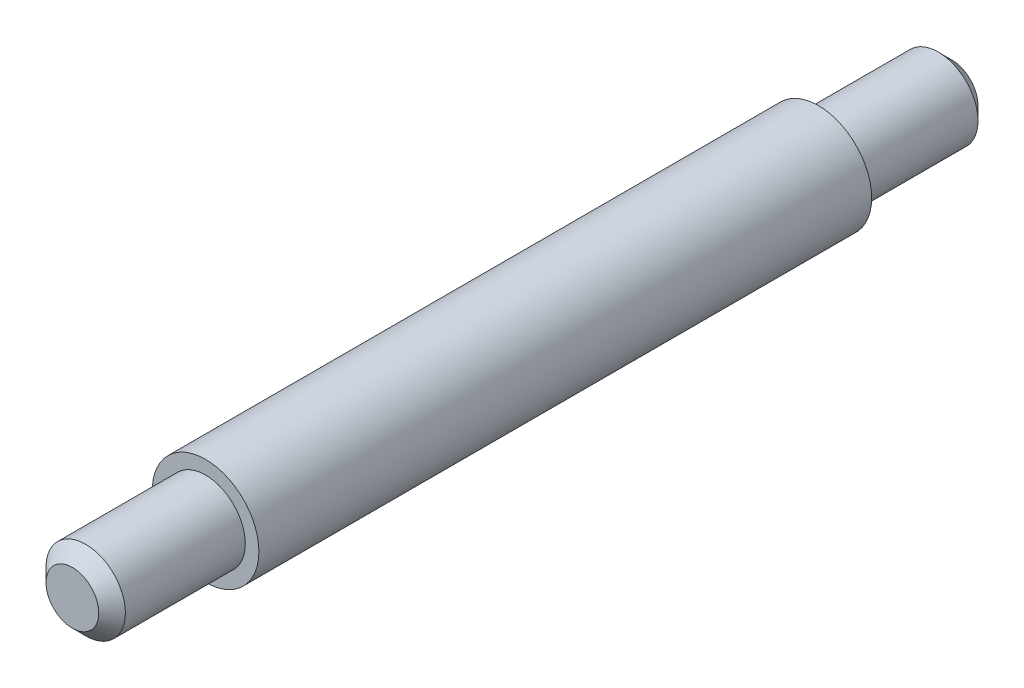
ISO-10303-21;
HEADER;
FILE_DESCRIPTION(('STEP AP214'),'2;1');
FILE_NAME('part.step','',(''),(''),'','','');
FILE_SCHEMA(('AUTOMOTIVE_DESIGN { 1 0 10303 214 1 1 1 1 }'));
ENDSEC;
DATA;
#1=APPLICATION_CONTEXT('core data for automotive mechanical design processes');
#2=APPLICATION_PROTOCOL_DEFINITION('international standard','automotive_design',2000,#1);
#3=PRODUCT_CONTEXT('',#1,'mechanical');
#4=PRODUCT('Part','Part','',(#3));
#5=PRODUCT_RELATED_PRODUCT_CATEGORY('part','',(#4));
#6=PRODUCT_DEFINITION_FORMATION('','',#4);
#7=PRODUCT_DEFINITION_CONTEXT('part definition',#1,'design');
#8=PRODUCT_DEFINITION('design','',#6,#7);
#9=PRODUCT_DEFINITION_SHAPE('','',#8);
#10=(LENGTH_UNIT() NAMED_UNIT(*) SI_UNIT(.MILLI.,.METRE.));
#11=(NAMED_UNIT(*) PLANE_ANGLE_UNIT() SI_UNIT($,.RADIAN.));
#12=(NAMED_UNIT(*) SI_UNIT($,.STERADIAN.) SOLID_ANGLE_UNIT());
#13=UNCERTAINTY_MEASURE_WITH_UNIT(LENGTH_MEASURE(1.E-05),#10,'distance_accuracy_value','');
#14=(GEOMETRIC_REPRESENTATION_CONTEXT(3) GLOBAL_UNCERTAINTY_ASSIGNED_CONTEXT((#13)) GLOBAL_UNIT_ASSIGNED_CONTEXT((#10,
#11,#12)) REPRESENTATION_CONTEXT('',''));
#15=CARTESIAN_POINT('',(0.,0.,0.));
#16=DIRECTION('',(0.,0.,1.));
#17=DIRECTION('',(1.,0.,0.));
#18=AXIS2_PLACEMENT_3D('',#15,#16,#17);
#19=CARTESIAN_POINT('',(0.,0.,11.5));
#20=DIRECTION('',(0.,0.,1.));
#21=DIRECTION('',(1.,0.,0.));
#22=AXIS2_PLACEMENT_3D('',#19,#20,#21);
#23=PLANE('',#22);
#24=CARTESIAN_POINT('',(0.,0.,11.5));
#25=DIRECTION('',(0.,0.,1.));
#26=DIRECTION('',(1.,0.,0.));
#27=AXIS2_PLACEMENT_3D('',#24,#25,#26);
#28=CIRCLE('',#27,2.);
#29=CARTESIAN_POINT('',(2.,0.,11.5));
#30=VERTEX_POINT('',#29);
#31=EDGE_CURVE('E52',#30,#30,#28,.T.);
#32=ORIENTED_EDGE('',*,*,#31,.T.);
#33=EDGE_LOOP('',(#32));
#34=FACE_BOUND('',#33,.T.);
#35=CARTESIAN_POINT('',(0.,0.,11.5));
#36=DIRECTION('',(0.,0.,1.));
#37=DIRECTION('',(1.,0.,0.));
#38=AXIS2_PLACEMENT_3D('',#35,#36,#37);
#39=CIRCLE('',#38,1.49);
#40=CARTESIAN_POINT('',(1.49,0.,11.5));
#41=VERTEX_POINT('',#40);
#42=EDGE_CURVE('E56',#41,#41,#39,.T.);
#43=ORIENTED_EDGE('',*,*,#42,.F.);
#44=EDGE_LOOP('',(#43));
#45=FACE_BOUND('',#44,.T.);
#46=ADVANCED_FACE('F32',(#34,#45),#23,.T.);
#47=CARTESIAN_POINT('',(0.,0.,11.5));
#48=DIRECTION('',(0.,0.,-1.));
#49=DIRECTION('',(-1.,0.,0.));
#50=AXIS2_PLACEMENT_3D('',#47,#48,#49);
#51=CYLINDRICAL_SURFACE('',#50,2.);
#52=ORIENTED_EDGE('',*,*,#31,.F.);
#53=EDGE_LOOP('',(#52));
#54=FACE_BOUND('',#53,.T.);
#55=CARTESIAN_POINT('',(0.,0.,-11.5));
#56=DIRECTION('',(0.,0.,1.));
#57=DIRECTION('',(1.,0.,0.));
#58=AXIS2_PLACEMENT_3D('',#55,#56,#57);
#59=CIRCLE('',#58,2.);
#60=CARTESIAN_POINT('',(2.,0.,-11.5));
#61=VERTEX_POINT('',#60);
#62=EDGE_CURVE('E53',#61,#61,#59,.T.);
#63=ORIENTED_EDGE('',*,*,#62,.T.);
#64=EDGE_LOOP('',(#63));
#65=FACE_BOUND('',#64,.T.);
#66=ADVANCED_FACE('F84',(#54,#65),#51,.T.);
#67=CARTESIAN_POINT('',(0.,0.,-11.5));
#68=DIRECTION('',(0.,0.,1.));
#69=DIRECTION('',(1.,0.,0.));
#70=AXIS2_PLACEMENT_3D('',#67,#68,#69);
#71=PLANE('',#70);
#72=CARTESIAN_POINT('',(0.,0.,-11.5));
#73=DIRECTION('',(0.,0.,1.));
#74=DIRECTION('',(1.,0.,0.));
#75=AXIS2_PLACEMENT_3D('',#72,#73,#74);
#76=CIRCLE('',#75,1.49);
#77=CARTESIAN_POINT('',(1.49,0.,-11.5));
#78=VERTEX_POINT('',#77);
#79=EDGE_CURVE('E61',#78,#78,#76,.T.);
#80=ORIENTED_EDGE('',*,*,#79,.T.);
#81=EDGE_LOOP('',(#80));
#82=FACE_BOUND('',#81,.T.);
#83=ORIENTED_EDGE('',*,*,#62,.F.);
#84=EDGE_LOOP('',(#83));
#85=FACE_BOUND('',#84,.T.);
#86=ADVANCED_FACE('F65',(#82,#85),#71,.F.);
#87=CARTESIAN_POINT('',(0.,0.,16.5));
#88=DIRECTION('',(0.,0.,-1.));
#89=DIRECTION('',(-1.,0.,0.));
#90=AXIS2_PLACEMENT_3D('',#87,#88,#89);
#91=CYLINDRICAL_SURFACE('',#90,1.49);
#92=CARTESIAN_POINT('',(0.,0.,16.));
#93=DIRECTION('',(0.,0.,1.));
#94=DIRECTION('',(1.,0.,0.));
#95=AXIS2_PLACEMENT_3D('',#92,#93,#94);
#96=CIRCLE('',#95,1.49);
#97=CARTESIAN_POINT('',(1.49,0.,16.));
#98=VERTEX_POINT('',#97);
#99=EDGE_CURVE('E10',#98,#98,#96,.F.);
#100=ORIENTED_EDGE('',*,*,#99,.T.);
#101=EDGE_LOOP('',(#100));
#102=FACE_BOUND('',#101,.T.);
#103=ORIENTED_EDGE('',*,*,#42,.T.);
#104=EDGE_LOOP('',(#103));
#105=FACE_BOUND('',#104,.T.);
#106=ADVANCED_FACE('F81',(#102,#105),#91,.T.);
#107=CARTESIAN_POINT('',(0.,0.,16.5));
#108=DIRECTION('',(0.,0.,1.));
#109=DIRECTION('',(1.,0.,0.));
#110=AXIS2_PLACEMENT_3D('',#107,#108,#109);
#111=PLANE('',#110);
#112=CARTESIAN_POINT('',(0.,0.,16.5));
#113=DIRECTION('',(0.,0.,1.));
#114=DIRECTION('',(1.,0.,0.));
#115=AXIS2_PLACEMENT_3D('',#112,#113,#114);
#116=CIRCLE('',#115,0.990000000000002);
#117=CARTESIAN_POINT('',(0.990000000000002,0.,16.5));
#118=VERTEX_POINT('',#117);
#119=EDGE_CURVE('E39',#118,#118,#116,.T.);
#120=ORIENTED_EDGE('',*,*,#119,.T.);
#121=EDGE_LOOP('',(#120));
#122=FACE_BOUND('',#121,.T.);
#123=ADVANCED_FACE('F71',(#122),#111,.T.);
#124=CARTESIAN_POINT('',(0.,0.,-16.5));
#125=DIRECTION('',(0.,0.,1.));
#126=DIRECTION('',(1.,0.,0.));
#127=AXIS2_PLACEMENT_3D('',#124,#125,#126);
#128=CYLINDRICAL_SURFACE('',#127,1.49);
#129=CARTESIAN_POINT('',(0.,0.,-16.));
#130=DIRECTION('',(0.,0.,-1.));
#131=DIRECTION('',(-1.,0.,0.));
#132=AXIS2_PLACEMENT_3D('',#129,#130,#131);
#133=CIRCLE('',#132,1.49);
#134=CARTESIAN_POINT('',(-1.49,0.,-16.));
#135=VERTEX_POINT('',#134);
#136=EDGE_CURVE('E47',#135,#135,#133,.F.);
#137=ORIENTED_EDGE('',*,*,#136,.T.);
#138=EDGE_LOOP('',(#137));
#139=FACE_BOUND('',#138,.T.);
#140=ORIENTED_EDGE('',*,*,#79,.F.);
#141=EDGE_LOOP('',(#140));
#142=FACE_BOUND('',#141,.T.);
#143=ADVANCED_FACE('F68',(#139,#142),#128,.T.);
#144=CARTESIAN_POINT('',(0.,0.,-16.5));
#145=DIRECTION('',(0.,0.,-1.));
#146=DIRECTION('',(1.,0.,0.));
#147=AXIS2_PLACEMENT_3D('',#144,#145,#146);
#148=PLANE('',#147);
#149=CARTESIAN_POINT('',(0.,0.,-16.5));
#150=DIRECTION('',(0.,0.,-1.));
#151=DIRECTION('',(-1.,0.,0.));
#152=AXIS2_PLACEMENT_3D('',#149,#150,#151);
#153=CIRCLE('',#152,0.989999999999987);
#154=CARTESIAN_POINT('',(-0.989999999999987,0.,-16.5));
#155=VERTEX_POINT('',#154);
#156=EDGE_CURVE('E43',#155,#155,#153,.T.);
#157=ORIENTED_EDGE('',*,*,#156,.T.);
#158=EDGE_LOOP('',(#157));
#159=FACE_BOUND('',#158,.T.);
#160=ADVANCED_FACE('F70',(#159),#148,.T.);
#161=CARTESIAN_POINT('',(0.,0.,-16.));
#162=DIRECTION('',(0.,0.,1.));
#163=DIRECTION('',(1.,0.,0.));
#164=AXIS2_PLACEMENT_3D('',#161,#162,#163);
#165=CONICAL_SURFACE('',#164,1.49,0.785398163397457);
#166=ORIENTED_EDGE('',*,*,#156,.F.);
#167=EDGE_LOOP('',(#166));
#168=FACE_BOUND('',#167,.T.);
#169=ORIENTED_EDGE('',*,*,#136,.F.);
#170=EDGE_LOOP('',(#169));
#171=FACE_BOUND('',#170,.T.);
#172=ADVANCED_FACE('F78',(#168,#171),#165,.T.);
#173=CARTESIAN_POINT('',(0.,0.,16.5));
#174=DIRECTION('',(0.,0.,-1.));
#175=DIRECTION('',(-1.,0.,0.));
#176=AXIS2_PLACEMENT_3D('',#173,#174,#175);
#177=CONICAL_SURFACE('',#176,0.990000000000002,0.785398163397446);
#178=ORIENTED_EDGE('',*,*,#99,.F.);
#179=EDGE_LOOP('',(#178));
#180=FACE_BOUND('',#179,.T.);
#181=ORIENTED_EDGE('',*,*,#119,.F.);
#182=EDGE_LOOP('',(#181));
#183=FACE_BOUND('',#182,.T.);
#184=ADVANCED_FACE('F34',(#180,#183),#177,.T.);
#185=CLOSED_SHELL('',(#46,#66,#86,#106,#123,#143,#160,#172,#184));
#186=MANIFOLD_SOLID_BREP('B2',#185);
#187=ADVANCED_BREP_SHAPE_REPRESENTATION('',(#18,#186),#14);
#188=SHAPE_DEFINITION_REPRESENTATION(#9,#187);
ENDSEC;
END-ISO-10303-21;
